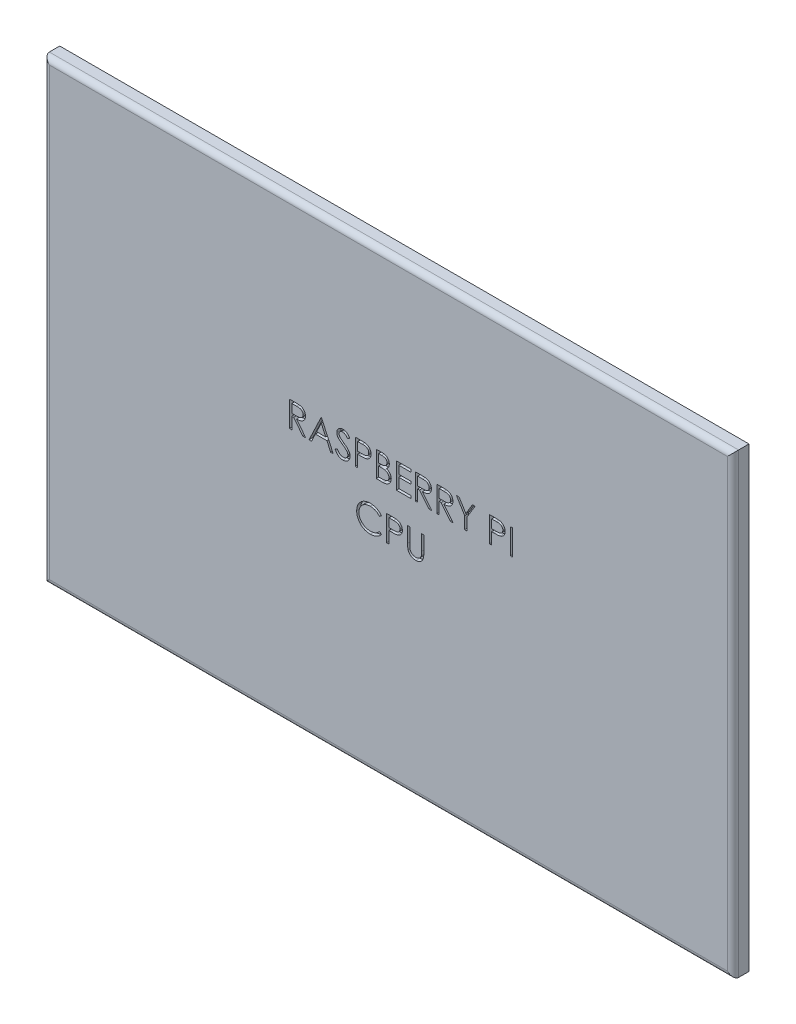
from build123d import *

# Parameters (mm, degrees)
SKETCH1_W           = 86
SKETCH1_H           = 57
BOSS_EXTRUDE1_DEPTH = 2
SKETCH2_W           = 0.284935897
SKETCH2_H           = 3.175
CUT_EXTRUDE1_DEPTH  = 0.5
FILLET1_R           = 0.7


with BuildPart() as part:
    # Sketch1 → Boss-Extrude1 (new body)
    with BuildSketch(Plane.XY):
        with Locations((8.866962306, -13.149667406)):
            Rectangle(SKETCH1_W, SKETCH1_H)
    extrude(amount=BOSS_EXTRUDE1_DEPTH)

    # Sketch2 → Cut-Extrude1 (cut)
    # profile 1 of 14: a face of its own
    with BuildSketch(Plane.XY.offset(2)):
        with BuildLine():
            Line((-3.468491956, -6.470796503), (-2.833110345, -6.470796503))
            add(Edge.make_bspline(
                [(-2.833110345, -6.470796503), (-2.790709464, -6.470937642), (-2.709295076, -6.471208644), (-2.592660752, -6.472719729), (-2.486681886, -6.477050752), (-2.391413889, -6.480777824), (-2.306858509, -6.487574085), (-2.232756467, -6.494069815), (-2.169449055, -6.502573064), (-2.131126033, -6.510470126), (-2.113774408, -6.514045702)],
                knots=[0, 0, 0, 0, 1.410062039, 2.707475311, 3.878576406, 4.937260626, 5.877586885, 6.699081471, 7.410979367, 8, 8, 8, 8], degree=3))
            add(Edge.make_bspline(
                [(-2.113774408, -6.514045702), (-2.090545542, -6.519784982), (-2.044583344, -6.531141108), (-1.978407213, -6.555143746), (-1.91534779, -6.582920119), (-1.855667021, -6.615544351), (-1.799663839, -6.653258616), (-1.7467608, -6.695411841), (-1.696717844, -6.741773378), (-1.651558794, -6.793512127), (-1.608978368, -6.847792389), (-1.573065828, -6.90648794), (-1.542108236, -6.967866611), (-1.517460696, -7.032552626), (-1.497614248, -7.099918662), (-1.483620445, -7.170574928), (-1.475228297, -7.244199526), (-1.474373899, -7.294417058), (-1.473940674, -7.319880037)],
                knots=[0, 0, 0, 0, 1.027469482, 2.033020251, 3.019912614, 3.986113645, 4.951240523, 5.91722682, 6.890402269, 7.87763091, 8.8651537, 9.85103654, 10.82876324, 11.815024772, 12.821070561, 13.842952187, 14.906261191, 16, 16, 16, 16], degree=3))
            add(Edge.make_bspline(
                [(-1.473940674, -7.319880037), (-1.475273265, -7.362184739), (-1.477873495, -7.44473217), (-1.502116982, -7.564530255), (-1.54182854, -7.676280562), (-1.59655038, -7.779842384), (-1.666236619, -7.87319704), (-1.749988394, -7.955194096), (-1.847852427, -8.023810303), (-1.938956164, -8.07139249), (-2.019432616, -8.101866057), (-2.085684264, -8.123307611), (-2.157953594, -8.139873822), (-2.235548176, -8.154714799), (-2.318790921, -8.16591955), (-2.407482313, -8.174126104), (-2.501685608, -8.179255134), (-2.566400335, -8.180018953), (-2.599691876, -8.180411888)],
                knots=[0, 0, 0, 0, 1.260483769, 2.459530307, 3.627416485, 4.787058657, 5.939039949, 7.08810263, 8.267026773, 9.491475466, 10.141966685, 10.831826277, 11.566392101, 12.351337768, 13.187381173, 14.07005841, 15.007169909, 16, 16, 16, 16], degree=3))
            Line((-2.599691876, -8.180411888), (-1.433235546, -9.645796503))
            Line((-1.433235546, -9.645796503), (-1.785589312, -9.645796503))
            Line((-1.785589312, -9.645796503), (-2.952045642, -8.180411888))
            Line((-2.952045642, -8.180411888), (-3.183556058, -8.180411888))
            Line((-3.183556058, -8.180411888), (-3.183556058, -9.645796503))
            Line((-3.183556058, -9.645796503), (-3.468491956, -9.645796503))
            Line((-3.468491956, -9.645796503), (-3.468491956, -6.470796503))
        make_face()
        with BuildLine():
            Line((-3.183556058, -6.796437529), (-3.183556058, -7.854770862))
            Line((-3.183556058, -7.854770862), (-2.602235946, -7.859222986))
            add(Edge.make_bspline(
                [(-2.602235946, -7.859222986), (-2.575094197, -7.859234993), (-2.522485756, -7.859258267), (-2.446375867, -7.855635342), (-2.375509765, -7.851513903), (-2.310158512, -7.845209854), (-2.250292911, -7.837085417), (-2.195942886, -7.82692271), (-2.147019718, -7.815082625), (-2.089961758, -7.796756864), (-2.02624719, -7.767722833), (-1.957003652, -7.725481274), (-1.898037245, -7.672350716), (-1.848218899, -7.611596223), (-1.8081872, -7.544797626), (-1.779964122, -7.472755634), (-1.762054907, -7.39728897), (-1.759942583, -7.345420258), (-1.758876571, -7.319244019)],
                knots=[0, 0, 0, 0, 1.146690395, 2.22261258, 3.21895312, 4.145990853, 4.996080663, 5.770904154, 6.481378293, 7.121626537, 8.300444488, 9.431385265, 10.535395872, 11.636531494, 12.74115979, 13.810798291, 14.895190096, 16, 16, 16, 16], degree=3))
            add(Edge.make_bspline(
                [(-1.758876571, -7.319244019), (-1.759967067, -7.293711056), (-1.762128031, -7.24311404), (-1.779770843, -7.169040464), (-1.80960621, -7.09912973), (-1.849812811, -7.033666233), (-1.898797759, -6.974243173), (-1.956236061, -6.923400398), (-2.020557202, -6.881445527), (-2.080674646, -6.854635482), (-2.134408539, -6.838198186), (-2.181062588, -6.826631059), (-2.233778, -6.817337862), (-2.292810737, -6.809891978), (-2.357908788, -6.803492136), (-2.429401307, -6.799181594), (-2.506813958, -6.796629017), (-2.560468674, -6.796502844), (-2.588243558, -6.796437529)],
                knots=[0, 0, 0, 0, 1.101028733, 2.181837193, 3.264309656, 4.369019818, 5.486613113, 6.575447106, 7.666700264, 8.788928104, 9.402425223, 10.0903467, 10.862060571, 11.710948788, 12.657782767, 13.684531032, 14.801375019, 16, 16, 16, 16], degree=3))
            Line((-2.588243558, -6.796437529), (-3.183556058, -6.796437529))
        make_face(mode=Mode.SUBTRACT)
    # profile 2 of 14: a face of its own
    with BuildSketch(Plane.XY.offset(2)):
        Polygon((0.520610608, -6.470796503), (1.985995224, -9.645796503), (1.676254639, -9.645796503), (1.206873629, -8.628168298), (-0.232434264, -8.628168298), (-0.715171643, -9.645796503), (-1.026184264, -9.645796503), (0.47990548, -6.470796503), align=None)
        Polygon((0.497077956, -7.089641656), (-0.07788198, -8.302527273), (1.056773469, -8.302527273), align=None, mode=Mode.SUBTRACT)
    # profile 3 of 14: a face of its own
    with BuildSketch(Plane.XY.offset(2)):
        with BuildLine():
            Line((2.230225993, -9.033311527), (2.498625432, -8.872399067))
            add(Edge.make_bspline(
                [(2.498625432, -8.872399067), (2.523588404, -8.914186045), (2.571416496, -8.994248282), (2.651200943, -9.102432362), (2.733871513, -9.194382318), (2.820040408, -9.269563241), (2.909181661, -9.328753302), (3.001877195, -9.370665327), (3.097814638, -9.396805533), (3.163105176, -9.399980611), (3.195700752, -9.401565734)],
                knots=[0, 0, 0, 0, 1.272034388, 2.437168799, 3.508375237, 4.49857839, 5.41946034, 6.295179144, 7.148887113, 8, 8, 8, 8], degree=3))
            add(Edge.make_bspline(
                [(3.195700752, -9.401565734), (3.223538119, -9.400790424), (3.278725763, -9.39925337), (3.359971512, -9.384484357), (3.438876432, -9.361794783), (3.513814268, -9.32930008), (3.583751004, -9.289985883), (3.645079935, -9.242500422), (3.698098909, -9.189336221), (3.741468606, -9.130024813), (3.774742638, -9.066237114), (3.800316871, -9.000763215), (3.814509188, -8.932574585), (3.8166471, -8.886663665), (3.817725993, -8.863494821)],
                knots=[0, 0, 0, 0, 1.095163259, 2.171163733, 3.241058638, 4.321873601, 5.38011039, 6.391990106, 7.366004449, 8.327778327, 9.272591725, 10.192022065, 11.087607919, 12, 12, 12, 12], degree=3))
            add(Edge.make_bspline(
                [(3.817725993, -8.863494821), (3.816388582, -8.837059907), (3.813669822, -8.78332159), (3.790690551, -8.704037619), (3.754541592, -8.625576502), (3.721192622, -8.577043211), (3.703878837, -8.551846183)],
                knots=[0, 0, 0, 0, 0.938893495, 1.908633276, 2.914225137, 4, 4, 4, 4], degree=3))
            add(Edge.make_bspline(
                [(3.703878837, -8.551846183), (3.689663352, -8.53366085), (3.659819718, -8.495483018), (3.608513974, -8.438654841), (3.548310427, -8.380036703), (3.481269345, -8.317390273), (3.404948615, -8.2536292), (3.321738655, -8.185712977), (3.229515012, -8.116224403), (3.164836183, -8.069622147), (3.131462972, -8.045576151)],
                knots=[0, 0, 0, 0, 0.722233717, 1.516239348, 2.393582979, 3.351407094, 4.387010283, 5.505090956, 6.712668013, 8, 8, 8, 8], degree=3))
            add(Edge.make_bspline(
                [(3.131462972, -8.045576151), (3.098058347, -8.021783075), (3.034191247, -7.976292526), (2.944875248, -7.908779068), (2.865006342, -7.847053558), (2.79493952, -7.790534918), (2.7347056, -7.739215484), (2.683829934, -7.693588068), (2.643608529, -7.652418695), (2.621242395, -7.625711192), (2.611200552, -7.613720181)],
                knots=[0, 0, 0, 0, 1.452282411, 2.77665338, 3.964542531, 5.026858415, 5.96415736, 6.766646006, 7.446254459, 8, 8, 8, 8], degree=3))
            add(Edge.make_bspline(
                [(2.611200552, -7.613720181), (2.597164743, -7.595032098), (2.569561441, -7.558279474), (2.533125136, -7.500834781), (2.502156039, -7.442030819), (2.47787878, -7.38170957), (2.45743521, -7.320717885), (2.443684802, -7.258259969), (2.435074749, -7.19461608), (2.434193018, -7.15178669), (2.433751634, -7.130346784)],
                knots=[0, 0, 0, 0, 1.068054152, 2.10047183, 3.106115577, 4.101338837, 5.06977816, 6.043150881, 7.020423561, 8, 8, 8, 8], degree=3))
            add(Edge.make_bspline(
                [(2.433751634, -7.130346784), (2.434935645, -7.096755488), (2.43727836, -7.030290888), (2.457090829, -6.933198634), (2.488362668, -6.840500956), (2.532173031, -6.753115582), (2.588649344, -6.67331787), (2.654005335, -6.600189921), (2.731848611, -6.538714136), (2.817258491, -6.48500034), (2.910745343, -6.442957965), (3.00870852, -6.411243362), (3.111303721, -6.393273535), (3.180793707, -6.390694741), (3.216053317, -6.389386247)],
                knots=[0, 0, 0, 0, 1.005424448, 1.989358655, 2.955360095, 3.929531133, 4.905563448, 5.876582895, 6.856512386, 7.866279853, 8.892233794, 9.918561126, 10.94386622, 12, 12, 12, 12], degree=3))
            add(Edge.make_bspline(
                [(3.216053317, -6.389386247), (3.253467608, -6.390676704), (3.327872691, -6.393243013), (3.437318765, -6.415556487), (3.542693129, -6.452477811), (3.627459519, -6.494377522), (3.693801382, -6.536225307), (3.744395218, -6.57434329), (3.795664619, -6.618226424), (3.848023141, -6.667991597), (3.900583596, -6.724095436), (3.954126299, -6.786153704), (4.008776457, -6.853787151), (4.043933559, -6.902069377), (4.061956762, -6.926821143)],
                knots=[0, 0, 0, 0, 1.286793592, 2.559021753, 3.825965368, 5.121522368, 5.803751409, 6.523245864, 7.299691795, 8.125521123, 9.008227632, 9.944561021, 10.946284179, 12, 12, 12, 12], degree=3))
            Line((4.061956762, -6.926821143), (3.804369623, -7.122078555))
            add(Edge.make_bspline(
                [(3.804369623, -7.122078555), (3.788815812, -7.102040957), (3.758862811, -7.063453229), (3.713388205, -7.009413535), (3.670526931, -6.960050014), (3.628299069, -6.917173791), (3.588934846, -6.878436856), (3.550728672, -6.845271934), (3.514230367, -6.817354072), (3.468222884, -6.787560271), (3.410421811, -6.758026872), (3.33786441, -6.733035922), (3.262039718, -6.718018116), (3.210396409, -6.716032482), (3.184252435, -6.715027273)],
                knots=[0, 0, 0, 0, 1.181633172, 2.275549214, 3.290209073, 4.226197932, 5.078386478, 5.862611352, 6.581680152, 7.217281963, 8.414376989, 9.595101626, 10.782541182, 12, 12, 12, 12], degree=3))
            add(Edge.make_bspline(
                [(3.184252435, -6.715027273), (3.151453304, -6.716126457), (3.08820327, -6.718246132), (2.998404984, -6.741396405), (2.917584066, -6.777847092), (2.848139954, -6.828932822), (2.79032141, -6.889458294), (2.748497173, -6.959107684), (2.723323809, -7.036017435), (2.72025197, -7.089667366), (2.718687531, -7.116990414)],
                knots=[0, 0, 0, 0, 1.14458467, 2.207223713, 3.21896685, 4.227309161, 5.202851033, 6.127160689, 7.046193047, 8, 8, 8, 8], degree=3))
            add(Edge.make_bspline(
                [(2.718687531, -7.116990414), (2.719044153, -7.134000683), (2.71975798, -7.168049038), (2.72971369, -7.2183514), (2.742503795, -7.268526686), (2.762771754, -7.318349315), (2.790752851, -7.368690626), (2.827496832, -7.420417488), (2.873773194, -7.473985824), (2.909221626, -7.508826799), (2.927937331, -7.527221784)],
                knots=[0, 0, 0, 0, 0.858281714, 1.717966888, 2.583508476, 3.4729293, 4.427298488, 5.488583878, 6.674047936, 8, 8, 8, 8], degree=3))
            add(Edge.make_bspline(
                [(2.927937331, -7.527221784), (2.93488729, -7.533423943), (2.951398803, -7.548158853), (2.981584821, -7.572281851), (3.021447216, -7.602038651), (3.06994507, -7.638857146), (3.127972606, -7.681566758), (3.195536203, -7.729621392), (3.271882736, -7.784581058), (3.326059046, -7.823005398), (3.354705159, -7.843322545)],
                knots=[0, 0, 0, 0, 0.420754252, 0.999615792, 1.744751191, 2.668019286, 3.750313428, 4.999500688, 6.413464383, 8, 8, 8, 8], degree=3))
            add(Edge.make_bspline(
                [(3.354705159, -7.843322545), (3.389163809, -7.868397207), (3.455888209, -7.916950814), (3.550827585, -7.989899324), (3.636909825, -8.061244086), (3.71443716, -8.130529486), (3.784175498, -8.197229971), (3.845351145, -8.262147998), (3.898587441, -8.324818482), (3.955900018, -8.405166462), (4.014463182, -8.503846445), (4.06475655, -8.624748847), (4.096468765, -8.746121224), (4.100615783, -8.827697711), (4.10266189, -8.867946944)],
                knots=[0, 0, 0, 0, 1.163667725, 2.253281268, 3.268753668, 4.215851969, 5.092017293, 5.902905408, 6.650798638, 7.335211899, 8.59617414, 9.77448103, 10.901945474, 12, 12, 12, 12], degree=3))
            add(Edge.make_bspline(
                [(4.10266189, -8.867946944), (4.102065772, -8.896411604), (4.100885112, -8.952788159), (4.087313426, -9.03556955), (4.067429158, -9.11597041), (4.037459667, -9.19299692), (4.000880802, -9.26805824), (3.954465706, -9.339185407), (3.900665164, -9.40795264), (3.83894882, -9.472526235), (3.771415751, -9.53180457), (3.7000384, -9.584535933), (3.624699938, -9.628503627), (3.545809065, -9.664381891), (3.463347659, -9.69244301), (3.377343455, -9.712774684), (3.287654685, -9.725253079), (3.226694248, -9.726548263), (3.195700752, -9.72720676)],
                knots=[0, 0, 0, 0, 0.983748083, 1.948392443, 2.894712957, 3.844097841, 4.80183111, 5.778335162, 6.776009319, 7.81870978, 8.863265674, 9.881300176, 10.883814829, 11.87499822, 12.874611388, 13.892143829, 14.928324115, 16, 16, 16, 16], degree=3))
            add(Edge.make_bspline(
                [(3.195700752, -9.72720676), (3.17172012, -9.726743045), (3.124060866, -9.725821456), (3.053567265, -9.717674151), (2.98449778, -9.706146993), (2.91771911, -9.687846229), (2.852370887, -9.665642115), (2.788737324, -9.638302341), (2.726787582, -9.60553888), (2.666174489, -9.568078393), (2.607052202, -9.524483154), (2.549975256, -9.473707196), (2.493070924, -9.417150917), (2.438018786, -9.353278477), (2.38370529, -9.283121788), (2.331201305, -9.206024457), (2.279420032, -9.122406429), (2.246930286, -9.06356453), (2.230225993, -9.033311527)],
                knots=[0, 0, 0, 0, 0.915332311, 1.819136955, 2.706846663, 3.586547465, 4.459518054, 5.340707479, 6.227863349, 7.133153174, 8.059268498, 9.028702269, 10.047606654, 11.120612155, 12.245963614, 13.433783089, 14.680604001, 16, 16, 16, 16], degree=3))
        make_face()
    # profile 4 of 14: a face of its own
    with BuildSketch(Plane.XY.offset(2)):
        with BuildLine():
            Line((4.753943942, -6.470796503), (5.3766052, -6.470796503))
            add(Edge.make_bspline(
                [(5.3766052, -6.470796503), (5.419432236, -6.470843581), (5.501490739, -6.470933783), (5.619160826, -6.473668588), (5.726031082, -6.477321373), (5.821871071, -6.482384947), (5.906975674, -6.488368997), (5.980959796, -6.496761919), (6.044404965, -6.505525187), (6.082420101, -6.514434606), (6.099757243, -6.518497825)],
                knots=[0, 0, 0, 0, 1.415646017, 2.712440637, 3.8905458, 4.950247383, 5.884950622, 6.709939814, 7.411656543, 8, 8, 8, 8], degree=3))
            add(Edge.make_bspline(
                [(6.099757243, -6.518497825), (6.121704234, -6.52450488), (6.165081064, -6.53637744), (6.227584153, -6.560157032), (6.287050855, -6.588352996), (6.343685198, -6.62048757), (6.39679123, -6.657939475), (6.447161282, -6.699190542), (6.494350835, -6.74519318), (6.538094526, -6.795431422), (6.578267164, -6.849061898), (6.612856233, -6.906885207), (6.641818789, -6.967928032), (6.666659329, -7.032147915), (6.684537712, -7.100084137), (6.698005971, -7.171264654), (6.706554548, -7.245681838), (6.7073733, -7.296536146), (6.707790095, -7.322424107)],
                knots=[0, 0, 0, 0, 0.999701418, 1.975846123, 2.934577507, 3.890451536, 4.834027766, 5.787354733, 6.749476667, 7.726910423, 8.712836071, 9.690891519, 10.682875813, 11.679750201, 12.712814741, 13.765529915, 14.8625177, 16, 16, 16, 16], degree=3))
            add(Edge.make_bspline(
                [(6.707790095, -7.322424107), (6.707407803, -7.348529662), (6.706659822, -7.399606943), (6.697682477, -7.474330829), (6.685590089, -7.545739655), (6.666996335, -7.613675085), (6.642643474, -7.677733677), (6.614075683, -7.738894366), (6.579619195, -7.796116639), (6.5400271, -7.849608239), (6.495983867, -7.899419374), (6.447675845, -7.94518908), (6.395298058, -7.986649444), (6.339016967, -8.023893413), (6.27828389, -8.056057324), (6.214019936, -8.084865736), (6.145666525, -8.109060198), (6.098365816, -8.121787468), (6.074316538, -8.128258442)],
                knots=[0, 0, 0, 0, 1.121902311, 2.195077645, 3.232258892, 4.234102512, 5.217864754, 6.176164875, 7.132989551, 8.084763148, 9.034132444, 9.988522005, 10.94243251, 11.903244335, 12.886203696, 13.894208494, 14.929344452, 16, 16, 16, 16], degree=3))
            add(Edge.make_bspline(
                [(6.074316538, -8.128258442), (6.054425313, -8.132488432), (6.010832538, -8.141758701), (5.939038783, -8.152107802), (5.855449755, -8.160941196), (5.760179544, -8.167564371), (5.653313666, -8.173234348), (5.534794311, -8.177741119), (5.404388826, -8.180217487), (5.313428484, -8.180345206), (5.265938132, -8.180411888)],
                knots=[0, 0, 0, 0, 0.601384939, 1.31797006, 2.144135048, 3.087295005, 4.142315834, 5.309527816, 6.595305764, 8, 8, 8, 8], degree=3))
            Line((5.265938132, -8.180411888), (5.038879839, -8.180411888))
            Line((5.038879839, -8.180411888), (5.038879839, -9.645796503))
            Line((5.038879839, -9.645796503), (4.753943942, -9.645796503))
            Line((4.753943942, -9.645796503), (4.753943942, -6.470796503))
        make_face()
        with BuildLine():
            Line((5.038879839, -6.796437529), (5.038879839, -7.854770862))
            Line((5.038879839, -7.854770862), (5.594759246, -7.861767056))
            add(Edge.make_bspline(
                [(5.594759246, -7.861767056), (5.621900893, -7.861781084), (5.674297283, -7.861808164), (5.749985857, -7.858192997), (5.820207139, -7.854019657), (5.884745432, -7.847909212), (5.94362983, -7.839272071), (5.996958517, -7.830552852), (6.044317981, -7.817938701), (6.099743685, -7.800954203), (6.161505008, -7.771986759), (6.228694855, -7.729940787), (6.285636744, -7.676346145), (6.334911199, -7.616086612), (6.374014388, -7.549049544), (6.402640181, -7.477322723), (6.41945966, -7.401641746), (6.421714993, -7.349854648), (6.422854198, -7.323696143)],
                knots=[0, 0, 0, 0, 1.160613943, 2.240541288, 3.23993089, 4.169200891, 5.011653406, 5.7853311, 6.478053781, 7.106038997, 8.262395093, 9.384106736, 10.481365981, 11.59014053, 12.70357646, 13.786202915, 14.881775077, 16, 16, 16, 16], degree=3))
            add(Edge.make_bspline(
                [(6.422854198, -7.323696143), (6.421708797, -7.298170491), (6.419431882, -7.247428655), (6.402508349, -7.173062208), (6.374070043, -7.102091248), (6.334648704, -7.035894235), (6.286804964, -6.975851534), (6.231197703, -6.923693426), (6.167957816, -6.881763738), (6.109131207, -6.85470069), (6.056878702, -6.838176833), (6.011492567, -6.826615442), (5.960247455, -6.817384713), (5.903126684, -6.809910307), (5.840572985, -6.80351181), (5.772048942, -6.799170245), (5.697814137, -6.796628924), (5.646278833, -6.796502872), (5.619563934, -6.796437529)],
                knots=[0, 0, 0, 0, 1.120700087, 2.227813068, 3.331159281, 4.466773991, 5.599788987, 6.693661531, 7.80175334, 8.91857717, 9.525282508, 10.207424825, 10.974604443, 11.810962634, 12.737642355, 13.736264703, 14.826523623, 16, 16, 16, 16], degree=3))
            Line((5.619563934, -6.796437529), (5.038879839, -6.796437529))
        make_face(mode=Mode.SUBTRACT)
    # profile 5 of 14: a face of its own
    with BuildSketch(Plane.XY.offset(2)):
        with BuildLine():
            Line((7.359072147, -6.470796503), (7.978553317, -6.470796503))
            add(Edge.make_bspline(
                [(7.978553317, -6.470796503), (8.008877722, -6.470955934), (8.067653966, -6.47126495), (8.15312446, -6.476057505), (8.233178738, -6.482592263), (8.307840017, -6.49296099), (8.377073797, -6.505472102), (8.441088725, -6.520623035), (8.499681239, -6.538790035), (8.569633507, -6.567679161), (8.649390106, -6.610608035), (8.735748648, -6.674043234), (8.809593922, -6.751633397), (8.873262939, -6.839156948), (8.923882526, -6.935437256), (8.960503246, -7.03817952), (8.98368789, -7.146058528), (8.986072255, -7.220120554), (8.987277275, -7.257550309)],
                knots=[0, 0, 0, 0, 1.001505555, 1.941167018, 2.826882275, 3.653841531, 4.429895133, 5.150066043, 5.825578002, 6.45369114, 7.647487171, 8.808567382, 9.977351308, 11.170798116, 12.373658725, 13.556498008, 14.765093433, 16, 16, 16, 16], degree=3))
            add(Edge.make_bspline(
                [(8.987277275, -7.257550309), (8.98628557, -7.292613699), (8.984336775, -7.361516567), (8.965701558, -7.462294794), (8.936527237, -7.558226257), (8.89597319, -7.64896085), (8.843266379, -7.732448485), (8.780802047, -7.809362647), (8.705439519, -7.87644682), (8.648976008, -7.913950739), (8.620295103, -7.933001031)],
                knots=[0, 0, 0, 0, 1.044552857, 2.05264487, 3.044412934, 4.028983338, 5.005914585, 5.980388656, 6.974128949, 8, 8, 8, 8], degree=3))
            add(Edge.make_bspline(
                [(8.620295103, -7.933001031), (8.656363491, -7.946848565), (8.725371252, -7.97334233), (8.820336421, -8.020183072), (8.90215603, -8.071130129), (8.971459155, -8.126766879), (9.030729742, -8.186737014), (9.082484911, -8.251919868), (9.126645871, -8.323165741), (9.164485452, -8.399731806), (9.194011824, -8.480836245), (9.216124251, -8.565718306), (9.228794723, -8.654073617), (9.230597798, -8.714203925), (9.231508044, -8.744559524)],
                knots=[0, 0, 0, 0, 1.27268992, 2.434971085, 3.483601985, 4.442670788, 5.356604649, 6.2567628, 7.179492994, 8.113709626, 9.066344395, 10.018646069, 10.999752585, 12, 12, 12, 12], degree=3))
            add(Edge.make_bspline(
                [(9.231508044, -8.744559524), (9.230621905, -8.775553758), (9.228878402, -8.836535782), (9.216015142, -8.926120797), (9.194235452, -9.011732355), (9.164235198, -9.0939242), (9.125080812, -9.172537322), (9.077430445, -9.247660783), (9.020614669, -9.318539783), (8.957057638, -9.385961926), (8.885155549, -9.446584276), (8.807580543, -9.500573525), (8.723355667, -9.544974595), (8.633864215, -9.5822727), (8.5381023, -9.610763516), (8.436499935, -9.63069578), (8.329144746, -9.644126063), (8.255475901, -9.645230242), (8.217695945, -9.645796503)],
                knots=[0, 0, 0, 0, 0.978564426, 1.925352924, 2.850884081, 3.763762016, 4.682927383, 5.618979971, 6.567305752, 7.547517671, 8.540179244, 9.531824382, 10.526200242, 11.540722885, 12.589160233, 13.674978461, 14.80764778, 16, 16, 16, 16], degree=3))
            Line((8.217695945, -9.645796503), (7.359072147, -9.645796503))
            Line((7.359072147, -9.645796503), (7.359072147, -6.470796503))
        make_face()
        with BuildLine():
            Line((7.644008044, -6.796437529), (7.644008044, -7.814065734))
            Line((7.644008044, -7.814065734), (7.83544935, -7.814065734))
            add(Edge.make_bspline(
                [(7.83544935, -7.814065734), (7.863433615, -7.813702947), (7.917504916, -7.813001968), (7.995809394, -7.810993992), (8.068494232, -7.805371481), (8.135433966, -7.799750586), (8.196523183, -7.790611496), (8.251626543, -7.779732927), (8.301608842, -7.76822772), (8.359248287, -7.748661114), (8.424628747, -7.719743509), (8.494327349, -7.674865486), (8.555772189, -7.62141268), (8.607658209, -7.559735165), (8.6501229, -7.491820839), (8.679617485, -7.418753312), (8.699617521, -7.342353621), (8.701424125, -7.289904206), (8.702341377, -7.263274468)],
                knots=[0, 0, 0, 0, 1.156816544, 2.235205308, 3.236616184, 4.169592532, 5.011045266, 5.787822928, 6.49130361, 7.128639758, 8.301311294, 9.436451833, 10.541879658, 11.654887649, 12.756523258, 13.837046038, 14.901820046, 16, 16, 16, 16], degree=3))
            add(Edge.make_bspline(
                [(8.702341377, -7.263274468), (8.701864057, -7.245652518), (8.70092774, -7.211085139), (8.693259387, -7.160693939), (8.680225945, -7.113301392), (8.663485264, -7.068258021), (8.64009124, -7.026972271), (8.612547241, -6.988016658), (8.579268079, -6.952717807), (8.541388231, -6.919725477), (8.497837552, -6.890475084), (8.448642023, -6.864856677), (8.393136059, -6.844227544), (8.332255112, -6.826160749), (8.265062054, -6.813471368), (8.19233228, -6.80290008), (8.113470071, -6.797518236), (8.058909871, -6.7968058), (8.030706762, -6.796437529)],
                knots=[0, 0, 0, 0, 0.91205012, 1.789085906, 2.630437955, 3.453916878, 4.269457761, 5.079663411, 5.91843418, 6.774407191, 7.675494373, 8.627863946, 9.638891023, 10.736472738, 11.911756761, 13.175263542, 14.539845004, 16, 16, 16, 16], degree=3))
            Line((8.030706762, -6.796437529), (7.644008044, -6.796437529))
        make_face(mode=Mode.SUBTRACT)
        with BuildLine():
            Line((7.644008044, -8.13970676), (7.644008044, -9.320155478))
            Line((7.644008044, -9.320155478), (8.049787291, -9.320155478))
            add(Edge.make_bspline(
                [(8.049787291, -9.320155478), (8.078833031, -9.319807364), (8.134814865, -9.319136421), (8.21564241, -9.316946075), (8.290557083, -9.311963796), (8.359217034, -9.304120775), (8.422363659, -9.295613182), (8.479239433, -9.284172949), (8.530305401, -9.271065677), (8.589518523, -9.250805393), (8.656196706, -9.219330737), (8.728052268, -9.17187426), (8.791938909, -9.115338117), (8.846190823, -9.049905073), (8.890652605, -8.978756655), (8.922997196, -8.903331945), (8.942946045, -8.824877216), (8.945361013, -8.771385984), (8.946572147, -8.744559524)],
                knots=[0, 0, 0, 0, 1.160039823, 2.235823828, 3.228722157, 4.157150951, 4.99529583, 5.772374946, 6.472645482, 7.099169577, 8.269452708, 9.405989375, 10.527446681, 11.663510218, 12.788923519, 13.866172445, 14.929861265, 16, 16, 16, 16], degree=3))
            add(Edge.make_bspline(
                [(8.946572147, -8.744559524), (8.946321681, -8.727783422), (8.945824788, -8.694501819), (8.938331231, -8.645592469), (8.927432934, -8.598216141), (8.913343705, -8.55224419), (8.892824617, -8.50850777), (8.868870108, -8.466141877), (8.840783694, -8.425090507), (8.797019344, -8.373190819), (8.733363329, -8.313394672), (8.64291504, -8.254849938), (8.54007017, -8.207635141), (8.465478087, -8.187587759), (8.426945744, -8.1772318)],
                knots=[0, 0, 0, 0, 0.723448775, 1.435228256, 2.130040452, 2.821711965, 3.505591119, 4.210454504, 4.921174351, 5.648778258, 7.137944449, 8.670945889, 10.280296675, 12, 12, 12, 12], degree=3))
            add(Edge.make_bspline(
                [(8.426945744, -8.1772318), (8.411497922, -8.174097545), (8.378003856, -8.167301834), (8.323386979, -8.160128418), (8.261033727, -8.153737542), (8.190800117, -8.149010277), (8.112597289, -8.144123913), (8.026258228, -8.142223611), (7.932135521, -8.139956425), (7.866828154, -8.13979211), (7.83290528, -8.13970676)],
                knots=[0, 0, 0, 0, 0.634451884, 1.375622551, 2.216452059, 3.157844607, 4.20941857, 5.370758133, 6.634282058, 8, 8, 8, 8], degree=3))
            Line((7.83290528, -8.13970676), (7.644008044, -8.13970676))
        make_face(mode=Mode.SUBTRACT)
    # profile 6 of 14: a face of its own
    with BuildSketch(Plane.XY.offset(2)):
        Polygon((9.882790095, -6.470796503), (11.673815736, -6.470796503), (11.673815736, -6.796437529), (10.167725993, -6.796437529), (10.167725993, -7.773360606), (11.673815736, -7.773360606), (11.673815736, -8.099001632), (10.167725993, -8.099001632), (10.167725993, -9.320155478), (11.673815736, -9.320155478), (11.673815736, -9.645796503), (9.882790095, -9.645796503), align=None)
    # profile 7 of 14: a face of its own
    with BuildSketch(Plane.XY.offset(2)):
        with BuildLine():
            Line((12.243687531, -6.470796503), (12.879069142, -6.470796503))
            add(Edge.make_bspline(
                [(12.879069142, -6.470796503), (12.921470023, -6.470937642), (13.002884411, -6.471208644), (13.119518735, -6.472719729), (13.225497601, -6.477050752), (13.320765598, -6.480777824), (13.405320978, -6.487574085), (13.479423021, -6.494069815), (13.542730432, -6.502573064), (13.581053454, -6.510470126), (13.598405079, -6.514045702)],
                knots=[0, 0, 0, 0, 1.410062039, 2.707475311, 3.878576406, 4.937260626, 5.877586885, 6.699081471, 7.410979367, 8, 8, 8, 8], degree=3))
            add(Edge.make_bspline(
                [(13.598405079, -6.514045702), (13.621633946, -6.519784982), (13.667596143, -6.531141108), (13.733772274, -6.555143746), (13.796831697, -6.582920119), (13.856512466, -6.615544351), (13.912515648, -6.653258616), (13.965418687, -6.695411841), (14.015461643, -6.741773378), (14.060620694, -6.793512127), (14.103201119, -6.847792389), (14.139113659, -6.90648794), (14.170071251, -6.967866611), (14.194718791, -7.032552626), (14.214565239, -7.099918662), (14.228559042, -7.170574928), (14.23695119, -7.244199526), (14.237805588, -7.294417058), (14.238238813, -7.319880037)],
                knots=[0, 0, 0, 0, 1.027469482, 2.033020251, 3.019912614, 3.986113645, 4.951240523, 5.91722682, 6.890402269, 7.87763091, 8.8651537, 9.85103654, 10.82876324, 11.815024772, 12.821070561, 13.842952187, 14.906261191, 16, 16, 16, 16], degree=3))
            add(Edge.make_bspline(
                [(14.238238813, -7.319880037), (14.236906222, -7.362184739), (14.234305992, -7.44473217), (14.210062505, -7.564530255), (14.170350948, -7.676280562), (14.115629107, -7.779842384), (14.045942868, -7.87319704), (13.962191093, -7.955194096), (13.86432706, -8.023810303), (13.773223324, -8.07139249), (13.692746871, -8.101866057), (13.626495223, -8.123307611), (13.554225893, -8.139873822), (13.476631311, -8.154714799), (13.393388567, -8.16591955), (13.304697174, -8.174126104), (13.210493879, -8.179255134), (13.145779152, -8.180018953), (13.112487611, -8.180411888)],
                knots=[0, 0, 0, 0, 1.260483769, 2.459530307, 3.627416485, 4.787058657, 5.939039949, 7.08810263, 8.267026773, 9.491475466, 10.141966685, 10.831826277, 11.566392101, 12.351337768, 13.187381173, 14.07005841, 15.007169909, 16, 16, 16, 16], degree=3))
            Line((13.112487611, -8.180411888), (14.278943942, -9.645796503))
            Line((14.278943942, -9.645796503), (13.926590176, -9.645796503))
            Line((13.926590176, -9.645796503), (12.760133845, -8.180411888))
            Line((12.760133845, -8.180411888), (12.528623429, -8.180411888))
            Line((12.528623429, -8.180411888), (12.528623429, -9.645796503))
            Line((12.528623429, -9.645796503), (12.243687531, -9.645796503))
            Line((12.243687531, -9.645796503), (12.243687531, -6.470796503))
        make_face()
        with BuildLine():
            Line((12.528623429, -6.796437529), (12.528623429, -7.854770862))
            Line((12.528623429, -7.854770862), (13.109943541, -7.859222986))
            add(Edge.make_bspline(
                [(13.109943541, -7.859222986), (13.137085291, -7.859234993), (13.189693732, -7.859258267), (13.26580362, -7.855635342), (13.336669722, -7.851513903), (13.402020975, -7.845209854), (13.461886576, -7.837085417), (13.516236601, -7.82692271), (13.565159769, -7.815082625), (13.622217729, -7.796756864), (13.685932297, -7.767722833), (13.755175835, -7.725481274), (13.814142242, -7.672350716), (13.863960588, -7.611596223), (13.903992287, -7.544797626), (13.932215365, -7.472755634), (13.95012458, -7.39728897), (13.952236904, -7.345420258), (13.953302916, -7.319244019)],
                knots=[0, 0, 0, 0, 1.146690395, 2.22261258, 3.21895312, 4.145990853, 4.996080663, 5.770904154, 6.481378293, 7.121626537, 8.300444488, 9.431385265, 10.535395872, 11.636531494, 12.74115979, 13.810798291, 14.895190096, 16, 16, 16, 16], degree=3))
            add(Edge.make_bspline(
                [(13.953302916, -7.319244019), (13.95221242, -7.293711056), (13.950051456, -7.24311404), (13.932408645, -7.169040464), (13.902573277, -7.09912973), (13.862366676, -7.033666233), (13.813381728, -6.974243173), (13.755943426, -6.923400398), (13.691622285, -6.881445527), (13.631504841, -6.854635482), (13.577770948, -6.838198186), (13.531116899, -6.826631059), (13.478401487, -6.817337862), (13.41936875, -6.809891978), (13.354270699, -6.803492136), (13.28277818, -6.799181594), (13.205365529, -6.796629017), (13.151710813, -6.796502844), (13.123935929, -6.796437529)],
                knots=[0, 0, 0, 0, 1.101028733, 2.181837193, 3.264309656, 4.369019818, 5.486613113, 6.575447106, 7.666700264, 8.788928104, 9.402425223, 10.0903467, 10.862060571, 11.710948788, 12.657782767, 13.684531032, 14.801375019, 16, 16, 16, 16], degree=3))
            Line((13.123935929, -6.796437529), (12.528623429, -6.796437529))
        make_face(mode=Mode.SUBTRACT)
    # profile 8 of 14: a face of its own
    with BuildSketch(Plane.XY.offset(2)):
        with BuildLine():
            Line((14.930225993, -6.470796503), (15.565607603, -6.470796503))
            add(Edge.make_bspline(
                [(15.565607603, -6.470796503), (15.608008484, -6.470937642), (15.689422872, -6.471208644), (15.806057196, -6.472719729), (15.912036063, -6.477050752), (16.00730406, -6.480777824), (16.09185944, -6.487574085), (16.165961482, -6.494069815), (16.229268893, -6.502573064), (16.267591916, -6.510470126), (16.284943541, -6.514045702)],
                knots=[0, 0, 0, 0, 1.410062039, 2.707475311, 3.878576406, 4.937260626, 5.877586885, 6.699081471, 7.410979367, 8, 8, 8, 8], degree=3))
            add(Edge.make_bspline(
                [(16.284943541, -6.514045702), (16.308172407, -6.519784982), (16.354134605, -6.531141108), (16.420310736, -6.555143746), (16.483370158, -6.582920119), (16.543050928, -6.615544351), (16.59905411, -6.653258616), (16.651957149, -6.695411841), (16.702000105, -6.741773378), (16.747159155, -6.793512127), (16.789739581, -6.847792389), (16.82565212, -6.90648794), (16.856609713, -6.967866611), (16.881257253, -7.032552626), (16.9011037, -7.099918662), (16.915097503, -7.170574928), (16.923489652, -7.244199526), (16.92434405, -7.294417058), (16.924777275, -7.319880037)],
                knots=[0, 0, 0, 0, 1.027469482, 2.033020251, 3.019912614, 3.986113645, 4.951240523, 5.91722682, 6.890402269, 7.87763091, 8.8651537, 9.85103654, 10.82876324, 11.815024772, 12.821070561, 13.842952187, 14.906261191, 16, 16, 16, 16], degree=3))
            add(Edge.make_bspline(
                [(16.924777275, -7.319880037), (16.923444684, -7.362184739), (16.920844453, -7.44473217), (16.896600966, -7.564530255), (16.856889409, -7.676280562), (16.802167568, -7.779842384), (16.73248133, -7.87319704), (16.648729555, -7.955194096), (16.550865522, -8.023810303), (16.459761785, -8.07139249), (16.379285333, -8.101866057), (16.313033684, -8.123307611), (16.240764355, -8.139873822), (16.163169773, -8.154714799), (16.079927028, -8.16591955), (15.991235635, -8.174126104), (15.897032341, -8.179255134), (15.832317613, -8.180018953), (15.799026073, -8.180411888)],
                knots=[0, 0, 0, 0, 1.260483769, 2.459530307, 3.627416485, 4.787058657, 5.939039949, 7.08810263, 8.267026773, 9.491475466, 10.141966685, 10.831826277, 11.566392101, 12.351337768, 13.187381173, 14.07005841, 15.007169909, 16, 16, 16, 16], degree=3))
            Line((15.799026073, -8.180411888), (16.965482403, -9.645796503))
            Line((16.965482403, -9.645796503), (16.613128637, -9.645796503))
            Line((16.613128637, -9.645796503), (15.446672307, -8.180411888))
            Line((15.446672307, -8.180411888), (15.21516189, -8.180411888))
            Line((15.21516189, -8.180411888), (15.21516189, -9.645796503))
            Line((15.21516189, -9.645796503), (14.930225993, -9.645796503))
            Line((14.930225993, -9.645796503), (14.930225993, -6.470796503))
        make_face()
        with BuildLine():
            Line((15.21516189, -6.796437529), (15.21516189, -7.854770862))
            Line((15.21516189, -7.854770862), (15.796482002, -7.859222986))
            add(Edge.make_bspline(
                [(15.796482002, -7.859222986), (15.823623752, -7.859234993), (15.876232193, -7.859258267), (15.952342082, -7.855635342), (16.023208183, -7.851513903), (16.088559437, -7.845209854), (16.148425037, -7.837085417), (16.202775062, -7.82692271), (16.251698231, -7.815082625), (16.308756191, -7.796756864), (16.372470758, -7.767722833), (16.441714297, -7.725481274), (16.500680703, -7.672350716), (16.55049905, -7.611596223), (16.590530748, -7.544797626), (16.618753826, -7.472755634), (16.636663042, -7.39728897), (16.638775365, -7.345420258), (16.639841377, -7.319244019)],
                knots=[0, 0, 0, 0, 1.146690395, 2.22261258, 3.21895312, 4.145990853, 4.996080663, 5.770904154, 6.481378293, 7.121626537, 8.300444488, 9.431385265, 10.535395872, 11.636531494, 12.74115979, 13.810798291, 14.895190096, 16, 16, 16, 16], degree=3))
            add(Edge.make_bspline(
                [(16.639841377, -7.319244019), (16.638750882, -7.293711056), (16.636589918, -7.24311404), (16.618947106, -7.169040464), (16.589111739, -7.09912973), (16.548905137, -7.033666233), (16.49992019, -6.974243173), (16.442481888, -6.923400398), (16.378160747, -6.881445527), (16.318043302, -6.854635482), (16.26430941, -6.838198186), (16.217655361, -6.826631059), (16.164939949, -6.817337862), (16.105907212, -6.809891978), (16.040809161, -6.803492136), (15.969316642, -6.799181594), (15.891903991, -6.796629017), (15.838249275, -6.796502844), (15.81047439, -6.796437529)],
                knots=[0, 0, 0, 0, 1.101028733, 2.181837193, 3.264309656, 4.369019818, 5.486613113, 6.575447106, 7.666700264, 8.788928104, 9.402425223, 10.0903467, 10.862060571, 11.710948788, 12.657782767, 13.684531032, 14.801375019, 16, 16, 16, 16], degree=3))
            Line((15.81047439, -6.796437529), (15.21516189, -6.796437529))
        make_face(mode=Mode.SUBTRACT)
    # profile 9 of 14: a face of its own
    with BuildSketch(Plane.XY.offset(2)):
        Polygon((17.372533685, -6.470796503), (17.698810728, -6.470796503), (18.533265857, -7.835054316), (19.36644895, -6.470796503), (19.692725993, -6.470796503), (18.675097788, -8.136526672), (18.675097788, -9.645796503), (18.39016189, -9.645796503), (18.39016189, -8.136526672), align=None)
    # profile 10 of 14: a face of its own
    with BuildSketch(Plane.XY.offset(2)):
        with BuildLine():
            Line((21.483751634, -6.470796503), (22.106412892, -6.470796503))
            add(Edge.make_bspline(
                [(22.106412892, -6.470796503), (22.149239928, -6.470843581), (22.231298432, -6.470933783), (22.348968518, -6.473668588), (22.455838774, -6.477321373), (22.551678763, -6.482384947), (22.636783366, -6.488368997), (22.710767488, -6.496761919), (22.774212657, -6.505525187), (22.812227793, -6.514434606), (22.829564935, -6.518497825)],
                knots=[0, 0, 0, 0, 1.415646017, 2.712440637, 3.8905458, 4.950247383, 5.884950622, 6.709939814, 7.411656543, 8, 8, 8, 8], degree=3))
            add(Edge.make_bspline(
                [(22.829564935, -6.518497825), (22.851511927, -6.52450488), (22.894888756, -6.53637744), (22.957391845, -6.560157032), (23.016858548, -6.588352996), (23.07349289, -6.62048757), (23.126598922, -6.657939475), (23.176968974, -6.699190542), (23.224158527, -6.74519318), (23.267902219, -6.795431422), (23.308074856, -6.849061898), (23.342663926, -6.906885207), (23.371626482, -6.967928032), (23.396467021, -7.032147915), (23.414345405, -7.100084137), (23.427813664, -7.171264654), (23.43636224, -7.245681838), (23.437180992, -7.296536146), (23.437597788, -7.322424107)],
                knots=[0, 0, 0, 0, 0.999701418, 1.975846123, 2.934577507, 3.890451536, 4.834027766, 5.787354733, 6.749476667, 7.726910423, 8.712836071, 9.690891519, 10.682875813, 11.679750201, 12.712814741, 13.765529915, 14.8625177, 16, 16, 16, 16], degree=3))
            add(Edge.make_bspline(
                [(23.437597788, -7.322424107), (23.437215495, -7.348529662), (23.436467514, -7.399606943), (23.42749017, -7.474330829), (23.415397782, -7.545739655), (23.396804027, -7.613675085), (23.372451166, -7.677733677), (23.343883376, -7.738894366), (23.309426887, -7.796116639), (23.269834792, -7.849608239), (23.22579156, -7.899419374), (23.177483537, -7.94518908), (23.125105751, -7.986649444), (23.068824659, -8.023893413), (23.008091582, -8.056057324), (22.943827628, -8.084865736), (22.875474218, -8.109060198), (22.828173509, -8.121787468), (22.80412423, -8.128258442)],
                knots=[0, 0, 0, 0, 1.121902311, 2.195077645, 3.232258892, 4.234102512, 5.217864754, 6.176164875, 7.132989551, 8.084763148, 9.034132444, 9.988522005, 10.94243251, 11.903244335, 12.886203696, 13.894208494, 14.929344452, 16, 16, 16, 16], degree=3))
            add(Edge.make_bspline(
                [(22.80412423, -8.128258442), (22.784233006, -8.132488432), (22.740640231, -8.141758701), (22.668846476, -8.152107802), (22.585257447, -8.160941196), (22.489987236, -8.167564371), (22.383121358, -8.173234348), (22.264602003, -8.177741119), (22.134196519, -8.180217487), (22.043236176, -8.180345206), (21.995745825, -8.180411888)],
                knots=[0, 0, 0, 0, 0.601384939, 1.31797006, 2.144135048, 3.087295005, 4.142315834, 5.309527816, 6.595305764, 8, 8, 8, 8], degree=3))
            Line((21.995745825, -8.180411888), (21.768687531, -8.180411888))
            Line((21.768687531, -8.180411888), (21.768687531, -9.645796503))
            Line((21.768687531, -9.645796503), (21.483751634, -9.645796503))
            Line((21.483751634, -9.645796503), (21.483751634, -6.470796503))
        make_face()
        with BuildLine():
            Line((21.768687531, -6.796437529), (21.768687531, -7.854770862))
            Line((21.768687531, -7.854770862), (22.324566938, -7.861767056))
            add(Edge.make_bspline(
                [(22.324566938, -7.861767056), (22.351708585, -7.861781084), (22.404104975, -7.861808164), (22.479793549, -7.858192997), (22.550014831, -7.854019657), (22.614553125, -7.847909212), (22.673437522, -7.839272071), (22.726766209, -7.830552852), (22.774125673, -7.817938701), (22.829551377, -7.800954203), (22.8913127, -7.771986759), (22.958502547, -7.729940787), (23.015444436, -7.676346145), (23.064718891, -7.616086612), (23.103822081, -7.549049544), (23.132447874, -7.477322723), (23.149267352, -7.401641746), (23.151522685, -7.349854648), (23.15266189, -7.323696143)],
                knots=[0, 0, 0, 0, 1.160613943, 2.240541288, 3.23993089, 4.169200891, 5.011653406, 5.7853311, 6.478053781, 7.106038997, 8.262395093, 9.384106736, 10.481365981, 11.59014053, 12.70357646, 13.786202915, 14.881775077, 16, 16, 16, 16], degree=3))
            add(Edge.make_bspline(
                [(23.15266189, -7.323696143), (23.15151649, -7.298170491), (23.149239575, -7.247428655), (23.132316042, -7.173062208), (23.103877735, -7.102091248), (23.064456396, -7.035894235), (23.016612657, -6.975851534), (22.961005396, -6.923693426), (22.897765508, -6.881763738), (22.838938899, -6.85470069), (22.786686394, -6.838176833), (22.741300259, -6.826615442), (22.690055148, -6.817384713), (22.632934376, -6.809910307), (22.570380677, -6.80351181), (22.501856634, -6.799170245), (22.427621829, -6.796628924), (22.376086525, -6.796502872), (22.349371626, -6.796437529)],
                knots=[0, 0, 0, 0, 1.120700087, 2.227813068, 3.331159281, 4.466773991, 5.599788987, 6.693661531, 7.80175334, 8.91857717, 9.525282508, 10.207424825, 10.974604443, 11.810962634, 12.737642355, 13.736264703, 14.826523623, 16, 16, 16, 16], degree=3))
            Line((22.349371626, -6.796437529), (21.768687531, -6.796437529))
        make_face(mode=Mode.SUBTRACT)
    # profile 11 of 14: a face of its own
    with BuildSketch(Plane.XY.offset(2)):
        with Locations((24.231347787, -8.058296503)):
            Rectangle(SKETCH2_W, SKETCH2_H)
    # profile 12 of 14: a face of its own
    with BuildSketch(Plane.XY.offset(2)):
        with BuildLine():
            Line((8.010354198, -13.345055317), (7.761035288, -13.535860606))
            add(Edge.make_bspline(
                [(7.761035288, -13.535860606), (7.743249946, -13.514664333), (7.707919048, -13.47255756), (7.6510782, -13.413430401), (7.591840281, -13.358035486), (7.530227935, -13.306108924), (7.465132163, -13.259466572), (7.398129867, -13.215677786), (7.328100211, -13.176427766), (7.231261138, -13.128836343), (7.10458059, -13.07917376), (6.945109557, -13.037532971), (6.778638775, -13.01102519), (6.665066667, -13.008154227), (6.60729931, -13.006693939)],
                knots=[0, 0, 0, 0, 0.757959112, 1.505699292, 2.245454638, 2.979532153, 3.711538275, 4.438200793, 5.171680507, 5.909471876, 7.393775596, 8.890124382, 10.418191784, 12, 12, 12, 12], degree=3))
            add(Edge.make_bspline(
                [(6.60729931, -13.006693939), (6.575473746, -13.007060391), (6.512117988, -13.007789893), (6.418094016, -13.017413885), (6.325825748, -13.030940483), (6.235373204, -13.051011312), (6.14685152, -13.076386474), (6.059681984, -13.106708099), (5.975126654, -13.144222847), (5.892015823, -13.185686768), (5.812387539, -13.232520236), (5.737044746, -13.283604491), (5.666262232, -13.338367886), (5.599984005, -13.397015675), (5.538142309, -13.459283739), (5.481185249, -13.525835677), (5.429309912, -13.596458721), (5.38148804, -13.670221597), (5.338659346, -13.746909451), (5.302800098, -13.826806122), (5.271045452, -13.908543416), (5.245918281, -13.993044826), (5.226029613, -14.079715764), (5.212306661, -14.168788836), (5.202792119, -14.260077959), (5.202066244, -14.32195355), (5.201700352, -14.353143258)],
                knots=[0, 0, 0, 0, 1.054917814, 2.100044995, 3.131103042, 4.146048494, 5.169673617, 6.183595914, 7.203665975, 8.234915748, 9.262203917, 10.264457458, 11.251630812, 12.227803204, 13.197192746, 14.159520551, 15.12972552, 16.100847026, 17.073214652, 18.039054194, 19.002613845, 19.979014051, 20.95965708, 21.949030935, 22.966165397, 24, 24, 24, 24], degree=3))
            add(Edge.make_bspline(
                [(5.201700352, -14.353143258), (5.202845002, -14.400070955), (5.205092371, -14.492207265), (5.225093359, -14.627163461), (5.255487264, -14.756450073), (5.301039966, -14.879258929), (5.35720939, -14.997104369), (5.428184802, -15.107992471), (5.510386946, -15.213598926), (5.604978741, -15.311427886), (5.70876116, -15.400793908), (5.820111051, -15.479489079), (5.938751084, -15.545089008), (6.063371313, -15.599677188), (6.194930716, -15.641638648), (6.333192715, -15.67117896), (6.477856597, -15.690448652), (6.576707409, -15.692293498), (6.627015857, -15.693232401)],
                knots=[0, 0, 0, 0, 1.029171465, 2.020641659, 2.987623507, 3.938342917, 4.889210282, 5.84687017, 6.821220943, 7.821438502, 8.827599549, 9.822697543, 10.807740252, 11.797342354, 12.80366471, 13.83203677, 14.896651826, 16, 16, 16, 16], degree=3))
            add(Edge.make_bspline(
                [(6.627015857, -15.693232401), (6.682444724, -15.691700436), (6.791541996, -15.688685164), (6.951532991, -15.663140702), (7.10469115, -15.621722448), (7.251024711, -15.563757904), (7.39012114, -15.488405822), (7.52219811, -15.397058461), (7.647367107, -15.288846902), (7.722633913, -15.206221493), (7.761035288, -15.164065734)],
                knots=[0, 0, 0, 0, 1.028121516, 2.023589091, 2.998037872, 3.967518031, 4.937445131, 5.927275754, 6.942489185, 8, 8, 8, 8], degree=3))
            Line((7.761035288, -15.164065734), (8.010354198, -15.35296297))
            add(Edge.make_bspline(
                [(8.010354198, -15.35296297), (7.990289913, -15.378851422), (7.950257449, -15.430504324), (7.885434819, -15.503322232), (7.817147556, -15.571815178), (7.744888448, -15.635430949), (7.669488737, -15.6954425), (7.589594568, -15.750144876), (7.506256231, -15.800301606), (7.419756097, -15.846227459), (7.330186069, -15.886973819), (7.237653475, -15.92185688), (7.142557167, -15.951905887), (7.044892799, -15.976627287), (6.944457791, -15.995923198), (6.841614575, -16.008822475), (6.736141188, -16.017659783), (6.664983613, -16.018465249), (6.628923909, -16.018873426)],
                knots=[0, 0, 0, 0, 0.986787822, 1.968848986, 2.935600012, 3.899624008, 4.868462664, 5.837806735, 6.815139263, 7.798259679, 8.787526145, 9.778297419, 10.776456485, 11.791383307, 12.812564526, 13.85620153, 14.913611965, 16, 16, 16, 16], degree=3))
            add(Edge.make_bspline(
                [(6.628923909, -16.018873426), (6.594775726, -16.018635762), (6.527251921, -16.018165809), (6.427558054, -16.010552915), (6.33050322, -16.000166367), (6.236364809, -15.984527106), (6.144629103, -15.966071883), (6.056127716, -15.941332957), (5.969989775, -15.913620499), (5.886561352, -15.881049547), (5.805771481, -15.844295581), (5.727880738, -15.802756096), (5.652924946, -15.756780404), (5.580167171, -15.70738193), (5.51068222, -15.652973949), (5.443867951, -15.594312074), (5.379349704, -15.531594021), (5.339432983, -15.486368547), (5.319363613, -15.463630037)],
                knots=[0, 0, 0, 0, 1.114604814, 2.203992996, 3.262667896, 4.300477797, 5.318619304, 6.316056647, 7.298880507, 8.271930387, 9.238335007, 10.195173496, 11.151986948, 12.108099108, 13.064862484, 14.031167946, 15.010108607, 16, 16, 16, 16], degree=3))
            add(Edge.make_bspline(
                [(5.319363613, -15.463630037), (5.287218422, -15.424131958), (5.223316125, -15.345612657), (5.141559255, -15.218353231), (5.071575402, -15.085485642), (5.014991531, -14.946311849), (4.970756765, -14.801144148), (4.940112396, -14.64990936), (4.920199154, -14.492748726), (4.917921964, -14.385853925), (4.916764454, -14.331518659)],
                knots=[0, 0, 0, 0, 0.994628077, 1.977248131, 2.950237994, 3.925870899, 4.908910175, 5.911660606, 6.938484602, 8, 8, 8, 8], degree=3))
            add(Edge.make_bspline(
                [(4.916764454, -14.331518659), (4.918175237, -14.274409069), (4.920950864, -14.162049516), (4.944532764, -13.997154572), (4.982468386, -13.839174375), (5.03634985, -13.688403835), (5.104662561, -13.544049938), (5.18905099, -13.407215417), (5.288534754, -13.277025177), (5.402333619, -13.155454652), (5.527126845, -13.044293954), (5.660766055, -12.946498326), (5.802989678, -12.865111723), (5.952230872, -12.797079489), (6.109607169, -12.744787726), (6.274782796, -12.708181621), (6.447447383, -12.685396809), (6.565251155, -12.682516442), (6.625107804, -12.681052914)],
                knots=[0, 0, 0, 0, 1.032925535, 2.032216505, 3.007276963, 3.968222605, 4.92396291, 5.891752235, 6.871517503, 7.883894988, 8.900124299, 9.891468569, 10.874487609, 11.85992873, 12.854644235, 13.869047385, 14.917252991, 16, 16, 16, 16], degree=3))
            add(Edge.make_bspline(
                [(6.625107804, -12.681052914), (6.661588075, -12.681490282), (6.733797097, -12.682356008), (6.840615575, -12.690798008), (6.944612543, -12.704871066), (7.045859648, -12.724026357), (7.14484945, -12.747800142), (7.240825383, -12.77877027), (7.33435062, -12.81418198), (7.424835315, -12.854965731), (7.511845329, -12.900746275), (7.59535356, -12.951016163), (7.674696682, -13.005713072), (7.750432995, -13.06437181), (7.821295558, -13.12823336), (7.889296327, -13.195541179), (7.95212602, -13.268234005), (7.990909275, -13.319401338), (8.010354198, -13.345055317)],
                knots=[0, 0, 0, 0, 1.096760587, 2.17092713, 3.219439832, 4.250915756, 5.268269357, 6.278326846, 7.281116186, 8.274029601, 9.260640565, 10.235837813, 11.203064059, 12.156899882, 13.114053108, 14.069676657, 15.032185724, 16, 16, 16, 16], degree=3))
        make_face()
    # profile 13 of 14: a face of its own
    with BuildSketch(Plane.XY.offset(2)):
        with BuildLine():
            Line((8.661636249, -12.76246317), (9.284297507, -12.76246317))
            add(Edge.make_bspline(
                [(9.284297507, -12.76246317), (9.327124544, -12.762510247), (9.409183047, -12.762600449), (9.526853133, -12.765335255), (9.63372339, -12.76898804), (9.729563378, -12.774051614), (9.814667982, -12.780035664), (9.888652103, -12.788428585), (9.952097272, -12.797191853), (9.990112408, -12.806101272), (10.007449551, -12.810164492)],
                knots=[0, 0, 0, 0, 1.415646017, 2.712440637, 3.8905458, 4.950247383, 5.884950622, 6.709939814, 7.411656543, 8, 8, 8, 8], degree=3))
            add(Edge.make_bspline(
                [(10.007449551, -12.810164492), (10.029396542, -12.816171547), (10.072773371, -12.828044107), (10.13527646, -12.851823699), (10.194743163, -12.880019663), (10.251377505, -12.912154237), (10.304483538, -12.949606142), (10.354853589, -12.990857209), (10.402043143, -13.036859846), (10.445786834, -13.087098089), (10.485959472, -13.140728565), (10.520548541, -13.198551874), (10.549511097, -13.259594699), (10.574351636, -13.323814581), (10.59223002, -13.391750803), (10.605698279, -13.462931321), (10.614246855, -13.537348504), (10.615065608, -13.588202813), (10.615482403, -13.614090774)],
                knots=[0, 0, 0, 0, 0.999701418, 1.975846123, 2.934577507, 3.890451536, 4.834027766, 5.787354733, 6.749476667, 7.726910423, 8.712836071, 9.690891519, 10.682875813, 11.679750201, 12.712814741, 13.765529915, 14.8625177, 16, 16, 16, 16], degree=3))
            add(Edge.make_bspline(
                [(10.615482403, -13.614090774), (10.615100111, -13.640196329), (10.61435213, -13.69127361), (10.605374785, -13.765997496), (10.593282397, -13.837406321), (10.574688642, -13.905341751), (10.550335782, -13.969400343), (10.521767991, -14.030561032), (10.487311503, -14.087783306), (10.447719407, -14.141274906), (10.403676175, -14.19108604), (10.355368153, -14.236855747), (10.302990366, -14.278316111), (10.246709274, -14.31556008), (10.185976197, -14.347723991), (10.121712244, -14.376532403), (10.053358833, -14.400726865), (10.006058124, -14.413454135), (9.982008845, -14.419925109)],
                knots=[0, 0, 0, 0, 1.121902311, 2.195077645, 3.232258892, 4.234102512, 5.217864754, 6.176164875, 7.132989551, 8.084763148, 9.034132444, 9.988522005, 10.94243251, 11.903244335, 12.886203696, 13.894208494, 14.929344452, 16, 16, 16, 16], degree=3))
            add(Edge.make_bspline(
                [(9.982008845, -14.419925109), (9.962117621, -14.424155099), (9.918524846, -14.433425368), (9.846731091, -14.443774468), (9.763142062, -14.452607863), (9.667871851, -14.459231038), (9.561005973, -14.464901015), (9.442486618, -14.469407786), (9.312081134, -14.471884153), (9.221120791, -14.472011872), (9.17363044, -14.472078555)],
                knots=[0, 0, 0, 0, 0.601384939, 1.31797006, 2.144135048, 3.087295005, 4.142315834, 5.309527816, 6.595305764, 8, 8, 8, 8], degree=3))
            Line((9.17363044, -14.472078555), (8.946572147, -14.472078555))
            Line((8.946572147, -14.472078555), (8.946572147, -15.93746317))
            Line((8.946572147, -15.93746317), (8.661636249, -15.93746317))
            Line((8.661636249, -15.93746317), (8.661636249, -12.76246317))
        make_face()
        with BuildLine():
            Line((8.946572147, -13.088104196), (8.946572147, -14.146437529))
            Line((8.946572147, -14.146437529), (9.502451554, -14.153433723))
            add(Edge.make_bspline(
                [(9.502451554, -14.153433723), (9.529593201, -14.153447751), (9.581989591, -14.153474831), (9.657678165, -14.149859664), (9.727899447, -14.145686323), (9.79243774, -14.139575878), (9.851322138, -14.130938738), (9.904650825, -14.122219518), (9.952010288, -14.109605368), (10.007435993, -14.09262087), (10.069197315, -14.063653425), (10.136387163, -14.021607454), (10.193329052, -13.968012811), (10.242603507, -13.907753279), (10.281706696, -13.840716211), (10.310332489, -13.76898939), (10.327151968, -13.693308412), (10.3294073, -13.641521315), (10.330546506, -13.615362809)],
                knots=[0, 0, 0, 0, 1.160613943, 2.240541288, 3.23993089, 4.169200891, 5.011653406, 5.7853311, 6.478053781, 7.106038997, 8.262395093, 9.384106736, 10.481365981, 11.59014053, 12.70357646, 13.786202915, 14.881775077, 16, 16, 16, 16], degree=3))
            add(Edge.make_bspline(
                [(10.330546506, -13.615362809), (10.329401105, -13.589837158), (10.32712419, -13.539095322), (10.310200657, -13.464728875), (10.281762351, -13.393757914), (10.242341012, -13.327560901), (10.194497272, -13.267518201), (10.138890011, -13.215360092), (10.075650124, -13.173430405), (10.016823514, -13.146367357), (9.96457101, -13.1298435), (9.919184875, -13.118282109), (9.867939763, -13.10905138), (9.810818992, -13.101576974), (9.748265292, -13.095178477), (9.679741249, -13.090836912), (9.605506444, -13.088295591), (9.553971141, -13.088169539), (9.527256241, -13.088104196)],
                knots=[0, 0, 0, 0, 1.120700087, 2.227813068, 3.331159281, 4.466773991, 5.599788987, 6.693661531, 7.80175334, 8.91857717, 9.525282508, 10.207424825, 10.974604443, 11.810962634, 12.737642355, 13.736264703, 14.826523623, 16, 16, 16, 16], degree=3))
            Line((9.527256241, -13.088104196), (8.946572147, -13.088104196))
        make_face(mode=Mode.SUBTRACT)
    # profile 14 of 14: a face of its own
    with BuildSketch(Plane.XY.offset(2)):
        with BuildLine():
            Line((11.266764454, -12.76246317), (11.551700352, -12.76246317))
            Line((11.551700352, -12.76246317), (11.551700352, -14.664791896))
            add(Edge.make_bspline(
                [(11.551700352, -14.664791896), (11.551657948, -14.691716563), (11.55157748, -14.74281076), (11.552114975, -14.815534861), (11.553620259, -14.880189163), (11.554569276, -14.937022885), (11.5566805, -14.985775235), (11.558402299, -15.026710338), (11.560616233, -15.059634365), (11.563276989, -15.078848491), (11.564420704, -15.087107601)],
                knots=[0, 0, 0, 0, 1.528628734, 2.90083645, 4.128790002, 5.200304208, 6.127813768, 6.898992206, 7.526736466, 8, 8, 8, 8], degree=3))
            add(Edge.make_bspline(
                [(11.564420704, -15.087107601), (11.569117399, -15.116904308), (11.578246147, -15.174818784), (11.601511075, -15.257285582), (11.634002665, -15.331609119), (11.672504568, -15.400108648), (11.723243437, -15.460877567), (11.784025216, -15.516858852), (11.857665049, -15.565818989), (11.939544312, -15.610587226), (12.027795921, -15.646569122), (12.117976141, -15.673777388), (12.208729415, -15.690358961), (12.269486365, -15.692278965), (12.299657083, -15.693232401)],
                knots=[0, 0, 0, 0, 1.035780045, 2.013197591, 2.933192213, 3.817615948, 4.702609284, 5.640816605, 6.646850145, 7.73207398, 8.84249596, 9.914020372, 10.964143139, 12, 12, 12, 12], degree=3))
            add(Edge.make_bspline(
                [(12.299657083, -15.693232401), (12.325559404, -15.692258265), (12.377214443, -15.69031562), (12.453964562, -15.678285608), (12.528713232, -15.65660438), (12.601829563, -15.628628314), (12.670365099, -15.591664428), (12.734358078, -15.548964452), (12.791475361, -15.4988803), (12.843597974, -15.443453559), (12.888986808, -15.380915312), (12.92833063, -15.312627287), (12.960557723, -15.237561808), (12.976472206, -15.184807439), (12.984648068, -15.157705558)],
                knots=[0, 0, 0, 0, 0.994687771, 1.983630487, 2.973142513, 3.978332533, 4.983357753, 5.956394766, 6.925816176, 7.893390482, 8.871859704, 9.88551698, 10.913711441, 12, 12, 12, 12], degree=3))
            add(Edge.make_bspline(
                [(12.984648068, -15.157705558), (12.98736961, -15.146503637), (12.993434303, -15.121541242), (12.999101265, -15.079339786), (13.005003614, -15.029547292), (13.009098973, -14.971806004), (13.013091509, -14.906309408), (13.015480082, -14.832716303), (13.016584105, -14.751293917), (13.016913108, -14.694473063), (13.017084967, -14.664791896)],
                knots=[0, 0, 0, 0, 0.558680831, 1.244966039, 2.062412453, 2.990489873, 4.051219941, 5.244515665, 6.560634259, 8, 8, 8, 8], degree=3))
            Line((13.017084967, -14.664791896), (13.017084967, -12.76246317))
            Line((13.017084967, -12.76246317), (13.302020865, -12.76246317))
            Line((13.302020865, -12.76246317), (13.302020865, -14.680056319))
            add(Edge.make_bspline(
                [(13.302020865, -14.680056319), (13.301790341, -14.714616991), (13.301340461, -14.782064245), (13.297439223, -14.880898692), (13.291218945, -14.974654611), (13.282430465, -15.063344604), (13.270785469, -15.146651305), (13.257835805, -15.225304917), (13.241344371, -15.298740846), (13.222082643, -15.367531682), (13.200063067, -15.433014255), (13.171541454, -15.495161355), (13.139406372, -15.555862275), (13.10129308, -15.614198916), (13.058465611, -15.670429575), (13.009977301, -15.724213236), (12.957431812, -15.776409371), (12.89995564, -15.825679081), (12.838496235, -15.870862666), (12.773236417, -15.910593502), (12.70467749, -15.944179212), (12.632997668, -15.971825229), (12.558166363, -15.992612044), (12.480181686, -16.008101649), (12.398866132, -16.016903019), (12.34356248, -16.018211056), (12.315557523, -16.018873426)],
                knots=[0, 0, 0, 0, 1.316592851, 2.569410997, 3.76748051, 4.895814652, 5.963796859, 6.97159953, 7.931736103, 8.829262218, 9.692595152, 10.560224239, 11.431080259, 12.30701507, 13.211635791, 14.121146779, 15.063487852, 16.031507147, 17.00238618, 17.966455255, 18.938106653, 19.907068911, 20.888905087, 21.893141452, 22.933117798, 24, 24, 24, 24], degree=3))
            add(Edge.make_bspline(
                [(12.315557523, -16.018873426), (12.285014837, -16.018161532), (12.225090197, -16.016764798), (12.136790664, -16.008761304), (12.052141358, -15.993686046), (11.970248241, -15.974490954), (11.892226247, -15.948017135), (11.817030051, -15.917085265), (11.745947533, -15.879096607), (11.677825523, -15.836829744), (11.614484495, -15.789273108), (11.556338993, -15.737438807), (11.503293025, -15.682157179), (11.456240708, -15.622829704), (11.414402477, -15.559917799), (11.378361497, -15.493243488), (11.347415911, -15.422832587), (11.33144424, -15.373889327), (11.323370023, -15.349146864)],
                knots=[0, 0, 0, 0, 1.13879206, 2.234305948, 3.301075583, 4.341971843, 5.366689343, 6.369221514, 7.369726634, 8.367512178, 9.355451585, 10.318319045, 11.268648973, 12.207971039, 13.137398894, 14.081662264, 15.030215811, 16, 16, 16, 16], degree=3))
            add(Edge.make_bspline(
                [(11.323370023, -15.349146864), (11.318673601, -15.332244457), (11.308486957, -15.29558276), (11.297578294, -15.23490716), (11.288407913, -15.165043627), (11.279785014, -15.085987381), (11.274696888, -14.997677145), (11.270236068, -14.9001512), (11.266733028, -14.79329162), (11.266753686, -14.718856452), (11.266764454, -14.680056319)],
                knots=[0, 0, 0, 0, 0.625038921, 1.35572334, 2.194682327, 3.136881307, 4.189498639, 5.346923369, 6.617055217, 8, 8, 8, 8], degree=3))
            Line((11.266764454, -14.680056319), (11.266764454, -12.76246317))
        make_face()
    extrude(amount=-CUT_EXTRUDE1_DEPTH, mode=Mode.SUBTRACT)

    # Fillet1
    fillet1_edges = [part.edges().sort_by_distance(p)[0] for p in [
        (51.866962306, -13.149667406, 2),
        (8.866962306, 15.350332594, 2),
        (-34.133037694, -13.149667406, 2),
        (8.866962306, -41.649667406, 2),
    ]]
    fillet(fillet1_edges, radius=FILLET1_R)


solid = part.part
